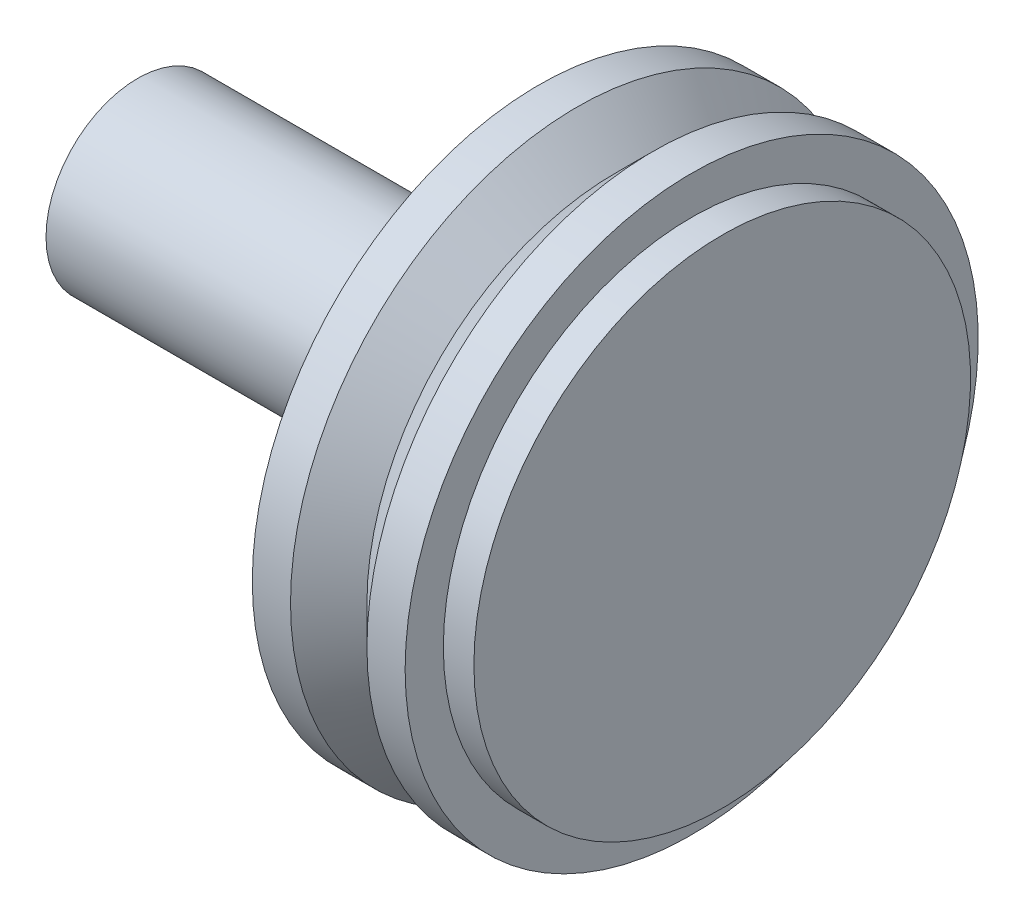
ISO-10303-21;
HEADER;
FILE_DESCRIPTION(('STEP AP214'),'2;1');
FILE_NAME('part.step','',(''),(''),'','','');
FILE_SCHEMA(('AUTOMOTIVE_DESIGN { 1 0 10303 214 1 1 1 1 }'));
ENDSEC;
DATA;
#1=APPLICATION_CONTEXT('core data for automotive mechanical design processes');
#2=APPLICATION_PROTOCOL_DEFINITION('international standard','automotive_design',2000,#1);
#3=PRODUCT_CONTEXT('',#1,'mechanical');
#4=PRODUCT('Part','Part','',(#3));
#5=PRODUCT_RELATED_PRODUCT_CATEGORY('part','',(#4));
#6=PRODUCT_DEFINITION_FORMATION('','',#4);
#7=PRODUCT_DEFINITION_CONTEXT('part definition',#1,'design');
#8=PRODUCT_DEFINITION('design','',#6,#7);
#9=PRODUCT_DEFINITION_SHAPE('','',#8);
#10=(LENGTH_UNIT() NAMED_UNIT(*) SI_UNIT(.MILLI.,.METRE.));
#11=(NAMED_UNIT(*) PLANE_ANGLE_UNIT() SI_UNIT($,.RADIAN.));
#12=(NAMED_UNIT(*) SI_UNIT($,.STERADIAN.) SOLID_ANGLE_UNIT());
#13=UNCERTAINTY_MEASURE_WITH_UNIT(LENGTH_MEASURE(1.E-05),#10,'distance_accuracy_value','');
#14=(GEOMETRIC_REPRESENTATION_CONTEXT(3) GLOBAL_UNCERTAINTY_ASSIGNED_CONTEXT((#13)) GLOBAL_UNIT_ASSIGNED_CONTEXT((#10,
#11,#12)) REPRESENTATION_CONTEXT('',''));
#15=CARTESIAN_POINT('',(0.,0.,0.));
#16=DIRECTION('',(0.,0.,1.));
#17=DIRECTION('',(1.,0.,0.));
#18=AXIS2_PLACEMENT_3D('',#15,#16,#17);
#19=CARTESIAN_POINT('',(145.,-75.,0.));
#20=DIRECTION('',(1.,0.,0.));
#21=DIRECTION('',(0.,0.,-1.));
#22=AXIS2_PLACEMENT_3D('',#19,#20,#21);
#23=PLANE('',#22);
#24=CARTESIAN_POINT('',(145.,0.,0.));
#25=DIRECTION('',(-1.,0.,0.));
#26=DIRECTION('',(0.,0.,1.));
#27=AXIS2_PLACEMENT_3D('',#24,#25,#26);
#28=CIRCLE('',#27,65.);
#29=CARTESIAN_POINT('',(145.,0.,65.));
#30=VERTEX_POINT('',#29);
#31=EDGE_CURVE('E61',#30,#30,#28,.T.);
#32=ORIENTED_EDGE('',*,*,#31,.T.);
#33=EDGE_LOOP('',(#32));
#34=FACE_BOUND('',#33,.T.);
#35=CARTESIAN_POINT('',(145.,0.,0.));
#36=DIRECTION('',(-1.,0.,0.));
#37=DIRECTION('',(0.,0.,1.));
#38=AXIS2_PLACEMENT_3D('',#35,#36,#37);
#39=CIRCLE('',#38,75.);
#40=CARTESIAN_POINT('',(145.,0.,75.));
#41=VERTEX_POINT('',#40);
#42=EDGE_CURVE('E10',#41,#41,#39,.T.);
#43=ORIENTED_EDGE('',*,*,#42,.F.);
#44=EDGE_LOOP('',(#43));
#45=FACE_BOUND('',#44,.T.);
#46=ADVANCED_FACE('F30',(#34,#45),#23,.T.);
#47=CARTESIAN_POINT('',(0.,0.,0.));
#48=DIRECTION('',(-1.,0.,0.));
#49=DIRECTION('',(0.,0.,1.));
#50=AXIS2_PLACEMENT_3D('',#47,#48,#49);
#51=CYLINDRICAL_SURFACE('',#50,75.);
#52=ORIENTED_EDGE('',*,*,#42,.T.);
#53=EDGE_LOOP('',(#52));
#54=FACE_BOUND('',#53,.T.);
#55=CARTESIAN_POINT('',(135.,0.,0.));
#56=DIRECTION('',(-1.,0.,0.));
#57=DIRECTION('',(0.,0.,1.));
#58=AXIS2_PLACEMENT_3D('',#55,#56,#57);
#59=CIRCLE('',#58,75.);
#60=CARTESIAN_POINT('',(135.,0.,75.));
#61=VERTEX_POINT('',#60);
#62=EDGE_CURVE('E36',#61,#61,#59,.T.);
#63=ORIENTED_EDGE('',*,*,#62,.F.);
#64=EDGE_LOOP('',(#63));
#65=FACE_BOUND('',#64,.T.);
#66=ADVANCED_FACE('F79',(#54,#65),#51,.T.);
#67=CARTESIAN_POINT('',(125.,0.,0.));
#68=DIRECTION('',(1.,0.,0.));
#69=DIRECTION('',(0.,0.,-1.));
#70=AXIS2_PLACEMENT_3D('',#67,#68,#69);
#71=CONICAL_SURFACE('',#70,65.,0.78539816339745);
#72=ORIENTED_EDGE('',*,*,#62,.T.);
#73=EDGE_LOOP('',(#72));
#74=FACE_BOUND('',#73,.T.);
#75=CARTESIAN_POINT('',(125.,0.,0.));
#76=DIRECTION('',(-1.,0.,0.));
#77=DIRECTION('',(0.,0.,1.));
#78=AXIS2_PLACEMENT_3D('',#75,#76,#77);
#79=CIRCLE('',#78,65.);
#80=CARTESIAN_POINT('',(125.,0.,65.));
#81=VERTEX_POINT('',#80);
#82=EDGE_CURVE('E40',#81,#81,#79,.T.);
#83=ORIENTED_EDGE('',*,*,#82,.F.);
#84=EDGE_LOOP('',(#83));
#85=FACE_BOUND('',#84,.T.);
#86=ADVANCED_FACE('F83',(#74,#85),#71,.T.);
#87=CARTESIAN_POINT('',(115.,0.,0.));
#88=DIRECTION('',(-1.,0.,0.));
#89=DIRECTION('',(0.,0.,1.));
#90=AXIS2_PLACEMENT_3D('',#87,#88,#89);
#91=CONICAL_SURFACE('',#90,75.,0.78539816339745);
#92=ORIENTED_EDGE('',*,*,#82,.T.);
#93=EDGE_LOOP('',(#92));
#94=FACE_BOUND('',#93,.T.);
#95=CARTESIAN_POINT('',(115.,0.,0.));
#96=DIRECTION('',(-1.,0.,0.));
#97=DIRECTION('',(0.,0.,1.));
#98=AXIS2_PLACEMENT_3D('',#95,#96,#97);
#99=CIRCLE('',#98,75.);
#100=CARTESIAN_POINT('',(115.,0.,75.));
#101=VERTEX_POINT('',#100);
#102=EDGE_CURVE('E44',#101,#101,#99,.T.);
#103=ORIENTED_EDGE('',*,*,#102,.F.);
#104=EDGE_LOOP('',(#103));
#105=FACE_BOUND('',#104,.T.);
#106=ADVANCED_FACE('F87',(#94,#105),#91,.T.);
#107=CARTESIAN_POINT('',(0.,0.,0.));
#108=DIRECTION('',(-1.,0.,0.));
#109=DIRECTION('',(0.,0.,1.));
#110=AXIS2_PLACEMENT_3D('',#107,#108,#109);
#111=CYLINDRICAL_SURFACE('',#110,75.);
#112=ORIENTED_EDGE('',*,*,#102,.T.);
#113=EDGE_LOOP('',(#112));
#114=FACE_BOUND('',#113,.T.);
#115=CARTESIAN_POINT('',(105.,0.,0.));
#116=DIRECTION('',(-1.,0.,0.));
#117=DIRECTION('',(0.,0.,1.));
#118=AXIS2_PLACEMENT_3D('',#115,#116,#117);
#119=CIRCLE('',#118,75.);
#120=CARTESIAN_POINT('',(105.,0.,75.));
#121=VERTEX_POINT('',#120);
#122=EDGE_CURVE('E49',#121,#121,#119,.T.);
#123=ORIENTED_EDGE('',*,*,#122,.F.);
#124=EDGE_LOOP('',(#123));
#125=FACE_BOUND('',#124,.T.);
#126=ADVANCED_FACE('F93',(#114,#125),#111,.T.);
#127=CARTESIAN_POINT('',(105.,-75.,0.));
#128=DIRECTION('',(-1.,0.,0.));
#129=DIRECTION('',(0.,0.,1.));
#130=AXIS2_PLACEMENT_3D('',#127,#128,#129);
#131=PLANE('',#130);
#132=ORIENTED_EDGE('',*,*,#122,.T.);
#133=EDGE_LOOP('',(#132));
#134=FACE_BOUND('',#133,.T.);
#135=CARTESIAN_POINT('',(105.,0.,0.));
#136=DIRECTION('',(-1.,0.,0.));
#137=DIRECTION('',(0.,0.,1.));
#138=AXIS2_PLACEMENT_3D('',#135,#136,#137);
#139=CIRCLE('',#138,24.);
#140=CARTESIAN_POINT('',(105.,0.,24.));
#141=VERTEX_POINT('',#140);
#142=EDGE_CURVE('E52',#141,#141,#139,.T.);
#143=ORIENTED_EDGE('',*,*,#142,.F.);
#144=EDGE_LOOP('',(#143));
#145=FACE_BOUND('',#144,.T.);
#146=ADVANCED_FACE('F97',(#134,#145),#131,.T.);
#147=CARTESIAN_POINT('',(0.,0.,0.));
#148=DIRECTION('',(-1.,0.,0.));
#149=DIRECTION('',(0.,0.,1.));
#150=AXIS2_PLACEMENT_3D('',#147,#148,#149);
#151=CYLINDRICAL_SURFACE('',#150,24.);
#152=ORIENTED_EDGE('',*,*,#142,.T.);
#153=EDGE_LOOP('',(#152));
#154=FACE_BOUND('',#153,.T.);
#155=CARTESIAN_POINT('',(0.,0.,0.));
#156=DIRECTION('',(-1.,0.,0.));
#157=DIRECTION('',(0.,0.,1.));
#158=AXIS2_PLACEMENT_3D('',#155,#156,#157);
#159=CIRCLE('',#158,24.);
#160=CARTESIAN_POINT('',(0.,0.,24.));
#161=VERTEX_POINT('',#160);
#162=EDGE_CURVE('E55',#161,#161,#159,.T.);
#163=ORIENTED_EDGE('',*,*,#162,.F.);
#164=EDGE_LOOP('',(#163));
#165=FACE_BOUND('',#164,.T.);
#166=ADVANCED_FACE('F101',(#154,#165),#151,.T.);
#167=CARTESIAN_POINT('',(0.,-24.,0.));
#168=DIRECTION('',(-1.,0.,0.));
#169=DIRECTION('',(0.,0.,1.));
#170=AXIS2_PLACEMENT_3D('',#167,#168,#169);
#171=PLANE('',#170);
#172=ORIENTED_EDGE('',*,*,#162,.T.);
#173=EDGE_LOOP('',(#172));
#174=FACE_BOUND('',#173,.T.);
#175=ADVANCED_FACE('F75',(#174),#171,.T.);
#176=CARTESIAN_POINT('',(153.,-65.,0.));
#177=DIRECTION('',(1.,0.,0.));
#178=DIRECTION('',(0.,0.,-1.));
#179=AXIS2_PLACEMENT_3D('',#176,#177,#178);
#180=PLANE('',#179);
#181=CARTESIAN_POINT('',(153.,0.,0.));
#182=DIRECTION('',(-1.,0.,0.));
#183=DIRECTION('',(0.,0.,1.));
#184=AXIS2_PLACEMENT_3D('',#181,#182,#183);
#185=CIRCLE('',#184,65.);
#186=CARTESIAN_POINT('',(153.,0.,65.));
#187=VERTEX_POINT('',#186);
#188=EDGE_CURVE('E58',#187,#187,#185,.T.);
#189=ORIENTED_EDGE('',*,*,#188,.F.);
#190=EDGE_LOOP('',(#189));
#191=FACE_BOUND('',#190,.T.);
#192=ADVANCED_FACE('F69',(#191),#180,.T.);
#193=CARTESIAN_POINT('',(0.,0.,0.));
#194=DIRECTION('',(-1.,0.,0.));
#195=DIRECTION('',(0.,0.,1.));
#196=AXIS2_PLACEMENT_3D('',#193,#194,#195);
#197=CYLINDRICAL_SURFACE('',#196,65.);
#198=ORIENTED_EDGE('',*,*,#188,.T.);
#199=EDGE_LOOP('',(#198));
#200=FACE_BOUND('',#199,.T.);
#201=ORIENTED_EDGE('',*,*,#31,.F.);
#202=EDGE_LOOP('',(#201));
#203=FACE_BOUND('',#202,.T.);
#204=ADVANCED_FACE('F67',(#200,#203),#197,.T.);
#205=CLOSED_SHELL('',(#46,#66,#86,#106,#126,#146,#166,#175,#192,#204));
#206=MANIFOLD_SOLID_BREP('B2',#205);
#207=ADVANCED_BREP_SHAPE_REPRESENTATION('',(#18,#206),#14);
#208=SHAPE_DEFINITION_REPRESENTATION(#9,#207);
ENDSEC;
END-ISO-10303-21;
